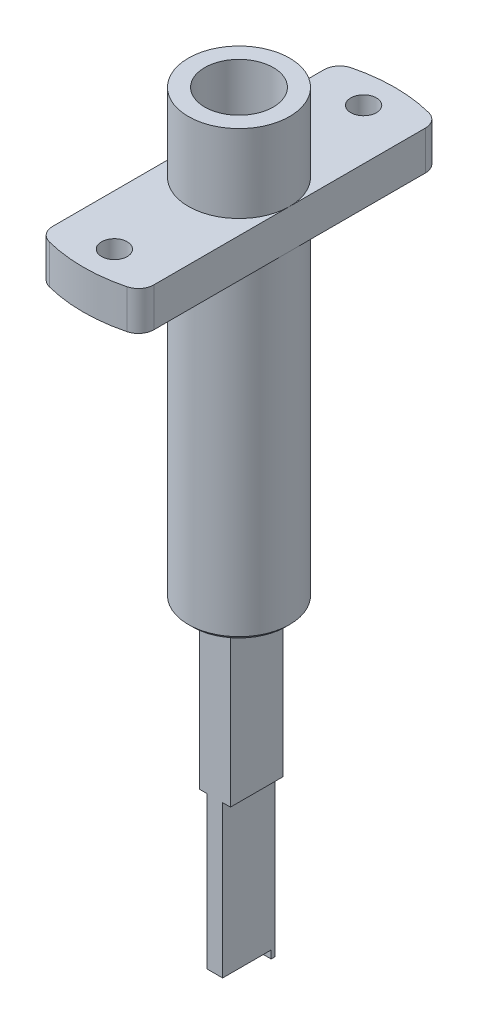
ISO-10303-21;
HEADER;
FILE_DESCRIPTION(('STEP AP214'),'2;1');
FILE_NAME('part.step','',(''),(''),'','','');
FILE_SCHEMA(('AUTOMOTIVE_DESIGN { 1 0 10303 214 1 1 1 1 }'));
ENDSEC;
DATA;
#1=APPLICATION_CONTEXT('core data for automotive mechanical design processes');
#2=APPLICATION_PROTOCOL_DEFINITION('international standard','automotive_design',2000,#1);
#3=PRODUCT_CONTEXT('',#1,'mechanical');
#4=PRODUCT('Part','Part','',(#3));
#5=PRODUCT_RELATED_PRODUCT_CATEGORY('part','',(#4));
#6=PRODUCT_DEFINITION_FORMATION('','',#4);
#7=PRODUCT_DEFINITION_CONTEXT('part definition',#1,'design');
#8=PRODUCT_DEFINITION('design','',#6,#7);
#9=PRODUCT_DEFINITION_SHAPE('','',#8);
#10=(LENGTH_UNIT() NAMED_UNIT(*) SI_UNIT(.MILLI.,.METRE.));
#11=(NAMED_UNIT(*) PLANE_ANGLE_UNIT() SI_UNIT($,.RADIAN.));
#12=(NAMED_UNIT(*) SI_UNIT($,.STERADIAN.) SOLID_ANGLE_UNIT());
#13=UNCERTAINTY_MEASURE_WITH_UNIT(LENGTH_MEASURE(1.E-05),#10,'distance_accuracy_value','');
#14=(GEOMETRIC_REPRESENTATION_CONTEXT(3) GLOBAL_UNCERTAINTY_ASSIGNED_CONTEXT((#13)) GLOBAL_UNIT_ASSIGNED_CONTEXT((#10,
#11,#12)) REPRESENTATION_CONTEXT('',''));
#15=CARTESIAN_POINT('',(0.,0.,0.));
#16=DIRECTION('',(0.,0.,1.));
#17=DIRECTION('',(1.,0.,0.));
#18=AXIS2_PLACEMENT_3D('',#15,#16,#17);
#19=CARTESIAN_POINT('',(-1.,-75.5,-5.1234753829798));
#20=DIRECTION('',(1.,0.,0.));
#21=DIRECTION('',(0.,0.,-1.));
#22=AXIS2_PLACEMENT_3D('',#19,#20,#21);
#23=PLANE('',#22);
#24=DIRECTION('',(0.,0.,1.));
#25=VECTOR('',#24,1.);
#26=CARTESIAN_POINT('',(-1.,-95.,0.));
#27=LINE('',#26,#25);
#28=CARTESIAN_POINT('',(-1.,-95.,-3.1234753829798));
#29=VERTEX_POINT('',#28);
#30=CARTESIAN_POINT('',(-1.,-95.,-2.1234753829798));
#31=VERTEX_POINT('',#30);
#32=EDGE_CURVE('E302',#29,#31,#27,.T.);
#33=ORIENTED_EDGE('',*,*,#32,.T.);
#34=DIRECTION('',(0.,-1.,0.));
#35=VECTOR('',#34,1.);
#36=CARTESIAN_POINT('',(-1.,-94.2928932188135,-2.1234753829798));
#37=LINE('',#36,#35);
#38=CARTESIAN_POINT('',(-1.,-96.,-2.1234753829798));
#39=VERTEX_POINT('',#38);
#40=EDGE_CURVE('E290',#31,#39,#37,.T.);
#41=ORIENTED_EDGE('',*,*,#40,.T.);
#42=DIRECTION('',(0.,0.,-1.));
#43=VECTOR('',#42,1.);
#44=CARTESIAN_POINT('',(-1.,-96.,2.6));
#45=LINE('',#44,#43);
#46=CARTESIAN_POINT('',(-1.,-96.,2.1));
#47=VERTEX_POINT('',#46);
#48=EDGE_CURVE('E299',#47,#39,#45,.T.);
#49=ORIENTED_EDGE('',*,*,#48,.F.);
#50=DIRECTION('',(0.,-1.,0.));
#51=VECTOR('',#50,1.);
#52=CARTESIAN_POINT('',(-1.,-94.2928932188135,2.1));
#53=LINE('',#52,#51);
#54=CARTESIAN_POINT('',(-1.,-95.,2.1));
#55=VERTEX_POINT('',#54);
#56=EDGE_CURVE('E125',#55,#47,#53,.T.);
#57=ORIENTED_EDGE('',*,*,#56,.F.);
#58=CARTESIAN_POINT('',(-1.,-95.,3.1));
#59=VERTEX_POINT('',#58);
#60=EDGE_CURVE('E356',#55,#59,#27,.T.);
#61=ORIENTED_EDGE('',*,*,#60,.T.);
#62=DIRECTION('',(0.,1.,0.));
#63=VECTOR('',#62,1.);
#64=CARTESIAN_POINT('',(-1.,-75.5,3.1));
#65=LINE('',#64,#63);
#66=CARTESIAN_POINT('',(-1.,-75.5,3.1));
#67=VERTEX_POINT('',#66);
#68=EDGE_CURVE('E596',#59,#67,#65,.T.);
#69=ORIENTED_EDGE('',*,*,#68,.T.);
#70=DIRECTION('',(0.,0.,1.));
#71=VECTOR('',#70,1.);
#72=CARTESIAN_POINT('',(-1.,-75.5,-5.1234753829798));
#73=LINE('',#72,#71);
#74=CARTESIAN_POINT('',(-1.,-75.5,-3.6234753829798));
#75=VERTEX_POINT('',#74);
#76=EDGE_CURVE('E351',#75,#67,#73,.T.);
#77=ORIENTED_EDGE('',*,*,#76,.F.);
#78=DIRECTION('',(0.,-1.,0.));
#79=VECTOR('',#78,1.);
#80=CARTESIAN_POINT('',(-1.,-75.5,-3.6234753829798));
#81=LINE('',#80,#79);
#82=CARTESIAN_POINT('',(-1.,-96.,-3.6234753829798));
#83=VERTEX_POINT('',#82);
#84=EDGE_CURVE('E318',#75,#83,#81,.T.);
#85=ORIENTED_EDGE('',*,*,#84,.T.);
#86=DIRECTION('',(0.,0.,-1.));
#87=VECTOR('',#86,1.);
#88=CARTESIAN_POINT('',(-1.,-96.,-5.1234753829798));
#89=LINE('',#88,#87);
#90=CARTESIAN_POINT('',(-1.,-96.,-3.1234753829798));
#91=VERTEX_POINT('',#90);
#92=EDGE_CURVE('E327',#91,#83,#89,.T.);
#93=ORIENTED_EDGE('',*,*,#92,.F.);
#94=DIRECTION('',(0.,1.,0.));
#95=VECTOR('',#94,1.);
#96=CARTESIAN_POINT('',(-1.,-96.,-3.1234753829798));
#97=LINE('',#96,#95);
#98=EDGE_CURVE('E330',#91,#29,#97,.T.);
#99=ORIENTED_EDGE('',*,*,#98,.T.);
#100=EDGE_LOOP('',(#33,#41,#49,#57,#61,#69,#77,#85,#93,#99));
#101=FACE_BOUND('',#100,.T.);
#102=ADVANCED_FACE('F101',(#101),#23,.F.);
#103=CARTESIAN_POINT('',(1.,-75.5,4.6));
#104=DIRECTION('',(-1.,0.,0.));
#105=DIRECTION('',(0.,0.,1.));
#106=AXIS2_PLACEMENT_3D('',#103,#104,#105);
#107=PLANE('',#106);
#108=DIRECTION('',(0.,0.,-1.));
#109=VECTOR('',#108,1.);
#110=CARTESIAN_POINT('',(1.,-75.5,4.6));
#111=LINE('',#110,#109);
#112=CARTESIAN_POINT('',(1.,-75.5,3.1));
#113=VERTEX_POINT('',#112);
#114=CARTESIAN_POINT('',(1.,-75.5,-3.6234753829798));
#115=VERTEX_POINT('',#114);
#116=EDGE_CURVE('E342',#113,#115,#111,.T.);
#117=ORIENTED_EDGE('',*,*,#116,.F.);
#118=DIRECTION('',(0.,-1.,0.));
#119=VECTOR('',#118,1.);
#120=CARTESIAN_POINT('',(1.,-75.5,3.1));
#121=LINE('',#120,#119);
#122=CARTESIAN_POINT('',(1.,-95.,3.1));
#123=VERTEX_POINT('',#122);
#124=EDGE_CURVE('E583',#113,#123,#121,.T.);
#125=ORIENTED_EDGE('',*,*,#124,.T.);
#126=DIRECTION('',(0.,0.,-1.));
#127=VECTOR('',#126,1.);
#128=CARTESIAN_POINT('',(1.,-95.,0.));
#129=LINE('',#128,#127);
#130=CARTESIAN_POINT('',(1.,-95.,-3.1234753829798));
#131=VERTEX_POINT('',#130);
#132=EDGE_CURVE('E345',#123,#131,#129,.T.);
#133=ORIENTED_EDGE('',*,*,#132,.T.);
#134=DIRECTION('',(0.,1.,0.));
#135=VECTOR('',#134,1.);
#136=CARTESIAN_POINT('',(1.,-96.,-3.1234753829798));
#137=LINE('',#136,#135);
#138=CARTESIAN_POINT('',(1.,-96.,-3.1234753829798));
#139=VERTEX_POINT('',#138);
#140=EDGE_CURVE('E334',#139,#131,#137,.T.);
#141=ORIENTED_EDGE('',*,*,#140,.F.);
#142=DIRECTION('',(0.,0.,1.));
#143=VECTOR('',#142,1.);
#144=CARTESIAN_POINT('',(1.,-96.,-5.1234753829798));
#145=LINE('',#144,#143);
#146=CARTESIAN_POINT('',(1.,-96.,-3.6234753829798));
#147=VERTEX_POINT('',#146);
#148=EDGE_CURVE('E315',#147,#139,#145,.T.);
#149=ORIENTED_EDGE('',*,*,#148,.F.);
#150=DIRECTION('',(0.,1.,0.));
#151=VECTOR('',#150,1.);
#152=CARTESIAN_POINT('',(1.,-75.5,-3.6234753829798));
#153=LINE('',#152,#151);
#154=EDGE_CURVE('E543',#147,#115,#153,.T.);
#155=ORIENTED_EDGE('',*,*,#154,.T.);
#156=EDGE_LOOP('',(#117,#125,#133,#141,#149,#155));
#157=FACE_BOUND('',#156,.T.);
#158=ADVANCED_FACE('F641',(#157),#107,.F.);
#159=CARTESIAN_POINT('',(0.,-95.,0.));
#160=DIRECTION('',(0.,-1.,0.));
#161=DIRECTION('',(0.,0.,-1.));
#162=AXIS2_PLACEMENT_3D('',#159,#160,#161);
#163=PLANE('',#162);
#164=DIRECTION('',(0.,0.,1.));
#165=VECTOR('',#164,1.);
#166=CARTESIAN_POINT('',(-0.5,-95.,2.6));
#167=LINE('',#166,#165);
#168=CARTESIAN_POINT('',(-0.5,-95.,-2.1234753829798));
#169=VERTEX_POINT('',#168);
#170=CARTESIAN_POINT('',(-0.5,-95.,-1.5));
#171=VERTEX_POINT('',#170);
#172=EDGE_CURVE('E357',#169,#171,#167,.T.);
#173=ORIENTED_EDGE('',*,*,#172,.F.);
#174=DIRECTION('',(1.,0.,0.));
#175=VECTOR('',#174,1.);
#176=CARTESIAN_POINT('',(-0.5,-95.,-2.1234753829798));
#177=LINE('',#176,#175);
#178=EDGE_CURVE('E304',#31,#169,#177,.T.);
#179=ORIENTED_EDGE('',*,*,#178,.F.);
#180=ORIENTED_EDGE('',*,*,#32,.F.);
#181=DIRECTION('',(-1.,0.,0.));
#182=VECTOR('',#181,1.);
#183=CARTESIAN_POINT('',(1.,-95.,-3.1234753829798));
#184=LINE('',#183,#182);
#185=EDGE_CURVE('E309',#131,#29,#184,.T.);
#186=ORIENTED_EDGE('',*,*,#185,.F.);
#187=ORIENTED_EDGE('',*,*,#132,.F.);
#188=DIRECTION('',(1.,0.,0.));
#189=VECTOR('',#188,1.);
#190=CARTESIAN_POINT('',(0.,-95.,3.1));
#191=LINE('',#190,#189);
#192=EDGE_CURVE('E593',#59,#123,#191,.T.);
#193=ORIENTED_EDGE('',*,*,#192,.F.);
#194=ORIENTED_EDGE('',*,*,#60,.F.);
#195=DIRECTION('',(-1.,0.,0.));
#196=VECTOR('',#195,1.);
#197=CARTESIAN_POINT('',(-0.5,-95.,2.1));
#198=LINE('',#197,#196);
#199=CARTESIAN_POINT('',(-0.5,-95.,2.1));
#200=VERTEX_POINT('',#199);
#201=EDGE_CURVE('E570',#200,#55,#198,.T.);
#202=ORIENTED_EDGE('',*,*,#201,.F.);
#203=CARTESIAN_POINT('',(-0.5,-95.,1.5));
#204=VERTEX_POINT('',#203);
#205=EDGE_CURVE('E361',#204,#200,#167,.T.);
#206=ORIENTED_EDGE('',*,*,#205,.F.);
#207=CARTESIAN_POINT('',(0.,-95.,1.5));
#208=DIRECTION('',(0.,-1.,0.));
#209=DIRECTION('',(0.,0.,-1.));
#210=AXIS2_PLACEMENT_3D('',#207,#208,#209);
#211=CIRCLE('',#210,0.5);
#212=CARTESIAN_POINT('',(0.5,-95.,1.5));
#213=VERTEX_POINT('',#212);
#214=EDGE_CURVE('E380',#213,#204,#211,.T.);
#215=ORIENTED_EDGE('',*,*,#214,.F.);
#216=DIRECTION('',(0.,0.,1.));
#217=VECTOR('',#216,1.);
#218=CARTESIAN_POINT('',(0.5,-95.,-1.5));
#219=LINE('',#218,#217);
#220=CARTESIAN_POINT('',(0.5,-95.,-1.5));
#221=VERTEX_POINT('',#220);
#222=EDGE_CURVE('E376',#221,#213,#219,.T.);
#223=ORIENTED_EDGE('',*,*,#222,.F.);
#224=CARTESIAN_POINT('',(0.,-95.,-1.5));
#225=DIRECTION('',(0.,-1.,0.));
#226=DIRECTION('',(0.,0.,-1.));
#227=AXIS2_PLACEMENT_3D('',#224,#225,#226);
#228=CIRCLE('',#227,0.5);
#229=EDGE_CURVE('E373',#171,#221,#228,.T.);
#230=ORIENTED_EDGE('',*,*,#229,.F.);
#231=EDGE_LOOP('',(#173,#179,#180,#186,#187,#193,#194,#202,#206,#215,#223,#230));
#232=FACE_BOUND('',#231,.T.);
#233=ADVANCED_FACE('F560',(#232),#163,.T.);
#234=CARTESIAN_POINT('',(2.,-44.1717960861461,5.1234753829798));
#235=DIRECTION('',(-1.,0.,0.));
#236=DIRECTION('',(0.,0.,1.));
#237=AXIS2_PLACEMENT_3D('',#234,#235,#236);
#238=PLANE('',#237);
#239=DIRECTION('',(0.,0.,1.));
#240=VECTOR('',#239,1.);
#241=CARTESIAN_POINT('',(2.,-55.,5.1234753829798));
#242=LINE('',#241,#240);
#243=CARTESIAN_POINT('',(2.,-55.,-3.6234753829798));
#244=VERTEX_POINT('',#243);
#245=CARTESIAN_POINT('',(2.,-55.,3.1));
#246=VERTEX_POINT('',#245);
#247=EDGE_CURVE('E406',#244,#246,#242,.T.);
#248=ORIENTED_EDGE('',*,*,#247,.T.);
#249=DIRECTION('',(0.,-1.,0.));
#250=VECTOR('',#249,1.);
#251=CARTESIAN_POINT('',(2.,-50.7279981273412,3.1));
#252=LINE('',#251,#250);
#253=CARTESIAN_POINT('',(2.,-75.5,3.1));
#254=VERTEX_POINT('',#253);
#255=EDGE_CURVE('E584',#246,#254,#252,.T.);
#256=ORIENTED_EDGE('',*,*,#255,.T.);
#257=DIRECTION('',(0.,0.,1.));
#258=VECTOR('',#257,1.);
#259=CARTESIAN_POINT('',(2.,-75.5,4.6));
#260=LINE('',#259,#258);
#261=CARTESIAN_POINT('',(2.,-75.5,-3.6234753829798));
#262=VERTEX_POINT('',#261);
#263=EDGE_CURVE('E338',#262,#254,#260,.T.);
#264=ORIENTED_EDGE('',*,*,#263,.F.);
#265=DIRECTION('',(0.,-1.,0.));
#266=VECTOR('',#265,1.);
#267=CARTESIAN_POINT('',(2.,-50.7279981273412,-3.6234753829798));
#268=LINE('',#267,#266);
#269=EDGE_CURVE('E603',#244,#262,#268,.T.);
#270=ORIENTED_EDGE('',*,*,#269,.F.);
#271=EDGE_LOOP('',(#248,#256,#264,#270));
#272=FACE_BOUND('',#271,.T.);
#273=ADVANCED_FACE('F636',(#272),#238,.F.);
#274=CARTESIAN_POINT('',(-2.,-44.1717960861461,5.1234753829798));
#275=DIRECTION('',(1.,0.,0.));
#276=DIRECTION('',(0.,0.,-1.));
#277=AXIS2_PLACEMENT_3D('',#274,#275,#276);
#278=PLANE('',#277);
#279=DIRECTION('',(0.,0.,-1.));
#280=VECTOR('',#279,1.);
#281=CARTESIAN_POINT('',(-2.,-75.5,-5.1234753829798));
#282=LINE('',#281,#280);
#283=CARTESIAN_POINT('',(-2.,-75.5,3.1));
#284=VERTEX_POINT('',#283);
#285=CARTESIAN_POINT('',(-2.,-75.5,-3.6234753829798));
#286=VERTEX_POINT('',#285);
#287=EDGE_CURVE('E348',#284,#286,#282,.T.);
#288=ORIENTED_EDGE('',*,*,#287,.F.);
#289=DIRECTION('',(0.,-1.,0.));
#290=VECTOR('',#289,1.);
#291=CARTESIAN_POINT('',(-2.,-50.7279981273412,3.1));
#292=LINE('',#291,#290);
#293=CARTESIAN_POINT('',(-2.,-55.,3.1));
#294=VERTEX_POINT('',#293);
#295=EDGE_CURVE('E572',#294,#284,#292,.T.);
#296=ORIENTED_EDGE('',*,*,#295,.F.);
#297=DIRECTION('',(0.,0.,-1.));
#298=VECTOR('',#297,1.);
#299=CARTESIAN_POINT('',(-2.,-55.,5.1234753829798));
#300=LINE('',#299,#298);
#301=CARTESIAN_POINT('',(-2.,-55.,-3.6234753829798));
#302=VERTEX_POINT('',#301);
#303=EDGE_CURVE('E403',#294,#302,#300,.T.);
#304=ORIENTED_EDGE('',*,*,#303,.T.);
#305=DIRECTION('',(0.,-1.,0.));
#306=VECTOR('',#305,1.);
#307=CARTESIAN_POINT('',(-2.,-50.7279981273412,-3.6234753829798));
#308=LINE('',#307,#306);
#309=EDGE_CURVE('E604',#302,#286,#308,.T.);
#310=ORIENTED_EDGE('',*,*,#309,.T.);
#311=EDGE_LOOP('',(#288,#296,#304,#310));
#312=FACE_BOUND('',#311,.T.);
#313=ADVANCED_FACE('F625',(#312),#278,.F.);
#314=CARTESIAN_POINT('',(0.,78.734060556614,0.));
#315=DIRECTION('',(0.,1.,0.));
#316=DIRECTION('',(0.,0.,1.));
#317=AXIS2_PLACEMENT_3D('',#314,#315,#316);
#318=CYLINDRICAL_SURFACE('',#317,6.49999999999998);
#319=CARTESIAN_POINT('',(0.,-54.5,0.));
#320=DIRECTION('',(0.,-1.,0.));
#321=DIRECTION('',(0.,0.,-1.));
#322=AXIS2_PLACEMENT_3D('',#319,#320,#321);
#323=CIRCLE('',#322,6.49999999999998);
#324=CARTESIAN_POINT('',(0.,-54.5,-6.49999999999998));
#325=VERTEX_POINT('',#324);
#326=EDGE_CURVE('E531',#325,#325,#323,.F.);
#327=ORIENTED_EDGE('',*,*,#326,.T.);
#328=EDGE_LOOP('',(#327));
#329=FACE_BOUND('',#328,.T.);
#330=CARTESIAN_POINT('',(0.,-13.,0.));
#331=DIRECTION('',(0.,1.,0.));
#332=DIRECTION('',(0.,0.,1.));
#333=AXIS2_PLACEMENT_3D('',#330,#331,#332);
#334=CIRCLE('',#333,6.49999999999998);
#335=CARTESIAN_POINT('',(-6.5,-13.,0.));
#336=VERTEX_POINT('',#335);
#337=CARTESIAN_POINT('',(6.50000000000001,-13.,0.));
#338=VERTEX_POINT('',#337);
#339=EDGE_CURVE('E463',#336,#338,#334,.F.);
#340=ORIENTED_EDGE('',*,*,#339,.T.);
#341=EDGE_CURVE('E468',#338,#336,#334,.F.);
#342=ORIENTED_EDGE('',*,*,#341,.T.);
#343=EDGE_LOOP('',(#340,#342));
#344=FACE_BOUND('',#343,.T.);
#345=ADVANCED_FACE('F690',(#329,#344),#318,.T.);
#346=CARTESIAN_POINT('',(0.,-8.,0.));
#347=DIRECTION('',(0.,1.,0.));
#348=DIRECTION('',(0.,0.,1.));
#349=AXIS2_PLACEMENT_3D('',#346,#347,#348);
#350=PLANE('',#349);
#351=CARTESIAN_POINT('',(0.,-8.,0.));
#352=DIRECTION('',(0.,1.,0.));
#353=DIRECTION('',(0.,0.,1.));
#354=AXIS2_PLACEMENT_3D('',#351,#352,#353);
#355=CIRCLE('',#354,20.);
#356=CARTESIAN_POINT('',(5.00000000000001,-8.,-19.3649167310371));
#357=VERTEX_POINT('',#356);
#358=CARTESIAN_POINT('',(-5.,-8.,-19.3649167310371));
#359=VERTEX_POINT('',#358);
#360=EDGE_CURVE('E453',#357,#359,#355,.T.);
#361=ORIENTED_EDGE('',*,*,#360,.T.);
#362=CARTESIAN_POINT('',(-4.5,-8.,-17.4284250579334));
#363=DIRECTION('',(0.,1.,0.));
#364=DIRECTION('',(0.,0.,1.));
#365=AXIS2_PLACEMENT_3D('',#362,#363,#364);
#366=CIRCLE('',#365,2.);
#367=CARTESIAN_POINT('',(-6.5,-8.,-17.4284250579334));
#368=VERTEX_POINT('',#367);
#369=EDGE_CURVE('E524',#359,#368,#366,.T.);
#370=ORIENTED_EDGE('',*,*,#369,.T.);
#371=DIRECTION('',(0.,0.,-1.));
#372=VECTOR('',#371,1.);
#373=CARTESIAN_POINT('',(-6.5,-8.,0.));
#374=LINE('',#373,#372);
#375=CARTESIAN_POINT('',(-6.5,-8.,0.));
#376=VERTEX_POINT('',#375);
#377=EDGE_CURVE('E467',#376,#368,#374,.T.);
#378=ORIENTED_EDGE('',*,*,#377,.F.);
#379=CARTESIAN_POINT('',(0.,-8.,0.));
#380=DIRECTION('',(0.,1.,0.));
#381=DIRECTION('',(0.,0.,1.));
#382=AXIS2_PLACEMENT_3D('',#379,#380,#381);
#383=CIRCLE('',#382,6.5);
#384=CARTESIAN_POINT('',(6.5,-8.,0.));
#385=VERTEX_POINT('',#384);
#386=EDGE_CURVE('E418',#385,#376,#383,.T.);
#387=ORIENTED_EDGE('',*,*,#386,.F.);
#388=DIRECTION('',(0.,0.,1.));
#389=VECTOR('',#388,1.);
#390=CARTESIAN_POINT('',(6.50000000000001,-8.,0.));
#391=LINE('',#390,#389);
#392=CARTESIAN_POINT('',(6.50000000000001,-8.,-17.4284250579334));
#393=VERTEX_POINT('',#392);
#394=EDGE_CURVE('E473',#393,#385,#391,.T.);
#395=ORIENTED_EDGE('',*,*,#394,.F.);
#396=CARTESIAN_POINT('',(4.50000000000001,-8.,-17.4284250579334));
#397=DIRECTION('',(0.,1.,0.));
#398=DIRECTION('',(0.,0.,1.));
#399=AXIS2_PLACEMENT_3D('',#396,#397,#398);
#400=CIRCLE('',#399,2.);
#401=EDGE_CURVE('E521',#393,#357,#400,.T.);
#402=ORIENTED_EDGE('',*,*,#401,.T.);
#403=EDGE_LOOP('',(#361,#370,#378,#387,#395,#402));
#404=FACE_BOUND('',#403,.T.);
#405=CARTESIAN_POINT('',(0.,-8.,-16.));
#406=DIRECTION('',(0.,1.,0.));
#407=DIRECTION('',(0.,0.,1.));
#408=AXIS2_PLACEMENT_3D('',#405,#406,#407);
#409=CIRCLE('',#408,1.65);
#410=CARTESIAN_POINT('',(0.,-8.,-14.35));
#411=VERTEX_POINT('',#410);
#412=EDGE_CURVE('E445',#411,#411,#409,.T.);
#413=ORIENTED_EDGE('',*,*,#412,.F.);
#414=EDGE_LOOP('',(#413));
#415=FACE_BOUND('',#414,.T.);
#416=ADVANCED_FACE('F740',(#404,#415),#350,.T.);
#417=CARTESIAN_POINT('',(0.,-13.,0.));
#418=DIRECTION('',(0.,1.,0.));
#419=DIRECTION('',(0.,0.,1.));
#420=AXIS2_PLACEMENT_3D('',#417,#418,#419);
#421=CYLINDRICAL_SURFACE('',#420,20.);
#422=CARTESIAN_POINT('',(-5.,-8.,19.3649167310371));
#423=VERTEX_POINT('',#422);
#424=CARTESIAN_POINT('',(5.00000000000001,-8.,19.3649167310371));
#425=VERTEX_POINT('',#424);
#426=EDGE_CURVE('E459',#423,#425,#355,.T.);
#427=ORIENTED_EDGE('',*,*,#426,.F.);
#428=DIRECTION('',(0.,1.,0.));
#429=VECTOR('',#428,1.);
#430=CARTESIAN_POINT('',(-5.,-13.,19.3649167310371));
#431=LINE('',#430,#429);
#432=CARTESIAN_POINT('',(-5.,-13.,19.3649167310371));
#433=VERTEX_POINT('',#432);
#434=EDGE_CURVE('E493',#423,#433,#431,.F.);
#435=ORIENTED_EDGE('',*,*,#434,.T.);
#436=CARTESIAN_POINT('',(0.,-13.,0.));
#437=DIRECTION('',(0.,1.,0.));
#438=DIRECTION('',(0.,0.,1.));
#439=AXIS2_PLACEMENT_3D('',#436,#437,#438);
#440=CIRCLE('',#439,20.);
#441=CARTESIAN_POINT('',(5.00000000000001,-13.,19.3649167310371));
#442=VERTEX_POINT('',#441);
#443=EDGE_CURVE('E458',#433,#442,#440,.T.);
#444=ORIENTED_EDGE('',*,*,#443,.T.);
#445=DIRECTION('',(0.,1.,0.));
#446=VECTOR('',#445,1.);
#447=CARTESIAN_POINT('',(5.00000000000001,-13.,19.3649167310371));
#448=LINE('',#447,#446);
#449=EDGE_CURVE('E490',#442,#425,#448,.T.);
#450=ORIENTED_EDGE('',*,*,#449,.T.);
#451=EDGE_LOOP('',(#427,#435,#444,#450));
#452=FACE_BOUND('',#451,.T.);
#453=ADVANCED_FACE('F736',(#452),#421,.T.);
#454=CARTESIAN_POINT('',(0.,-13.,0.));
#455=DIRECTION('',(0.,1.,0.));
#456=DIRECTION('',(0.,0.,1.));
#457=AXIS2_PLACEMENT_3D('',#454,#455,#456);
#458=PLANE('',#457);
#459=CARTESIAN_POINT('',(0.,-13.,-16.));
#460=DIRECTION('',(0.,1.,0.));
#461=DIRECTION('',(0.,0.,1.));
#462=AXIS2_PLACEMENT_3D('',#459,#460,#461);
#463=CIRCLE('',#462,1.65);
#464=CARTESIAN_POINT('',(0.,-13.,-14.35));
#465=VERTEX_POINT('',#464);
#466=EDGE_CURVE('E449',#465,#465,#463,.T.);
#467=ORIENTED_EDGE('',*,*,#466,.T.);
#468=EDGE_LOOP('',(#467));
#469=FACE_BOUND('',#468,.T.);
#470=DIRECTION('',(0.,0.,-1.));
#471=VECTOR('',#470,1.);
#472=CARTESIAN_POINT('',(-6.5,-13.,0.));
#473=LINE('',#472,#471);
#474=CARTESIAN_POINT('',(-6.5,-13.,-17.4284250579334));
#475=VERTEX_POINT('',#474);
#476=EDGE_CURVE('E432',#336,#475,#473,.T.);
#477=ORIENTED_EDGE('',*,*,#476,.T.);
#478=CARTESIAN_POINT('',(-4.5,-13.,-17.4284250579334));
#479=DIRECTION('',(0.,1.,0.));
#480=DIRECTION('',(0.,0.,1.));
#481=AXIS2_PLACEMENT_3D('',#478,#479,#480);
#482=CIRCLE('',#481,2.);
#483=CARTESIAN_POINT('',(-5.,-13.,-19.3649167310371));
#484=VERTEX_POINT('',#483);
#485=EDGE_CURVE('E512',#475,#484,#482,.F.);
#486=ORIENTED_EDGE('',*,*,#485,.T.);
#487=CARTESIAN_POINT('',(5.00000000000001,-13.,-19.3649167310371));
#488=VERTEX_POINT('',#487);
#489=EDGE_CURVE('E454',#488,#484,#440,.T.);
#490=ORIENTED_EDGE('',*,*,#489,.F.);
#491=CARTESIAN_POINT('',(4.50000000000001,-13.,-17.4284250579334));
#492=DIRECTION('',(0.,1.,0.));
#493=DIRECTION('',(0.,0.,1.));
#494=AXIS2_PLACEMENT_3D('',#491,#492,#493);
#495=CIRCLE('',#494,2.);
#496=CARTESIAN_POINT('',(6.50000000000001,-13.,-17.4284250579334));
#497=VERTEX_POINT('',#496);
#498=EDGE_CURVE('E509',#488,#497,#495,.F.);
#499=ORIENTED_EDGE('',*,*,#498,.T.);
#500=DIRECTION('',(0.,0.,1.));
#501=VECTOR('',#500,1.);
#502=CARTESIAN_POINT('',(6.50000000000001,-13.,0.));
#503=LINE('',#502,#501);
#504=EDGE_CURVE('E431',#497,#338,#503,.T.);
#505=ORIENTED_EDGE('',*,*,#504,.T.);
#506=ORIENTED_EDGE('',*,*,#339,.F.);
#507=EDGE_LOOP('',(#477,#486,#490,#499,#505,#506));
#508=FACE_BOUND('',#507,.T.);
#509=ADVANCED_FACE('F732',(#469,#508),#458,.F.);
#510=ORIENTED_EDGE('',*,*,#489,.T.);
#511=DIRECTION('',(0.,1.,0.));
#512=VECTOR('',#511,1.);
#513=CARTESIAN_POINT('',(-5.,-13.,-19.3649167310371));
#514=LINE('',#513,#512);
#515=EDGE_CURVE('E518',#484,#359,#514,.T.);
#516=ORIENTED_EDGE('',*,*,#515,.T.);
#517=ORIENTED_EDGE('',*,*,#360,.F.);
#518=DIRECTION('',(0.,1.,0.));
#519=VECTOR('',#518,1.);
#520=CARTESIAN_POINT('',(5.00000000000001,-13.,-19.3649167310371));
#521=LINE('',#520,#519);
#522=EDGE_CURVE('E515',#357,#488,#521,.F.);
#523=ORIENTED_EDGE('',*,*,#522,.T.);
#524=EDGE_LOOP('',(#510,#516,#517,#523));
#525=FACE_BOUND('',#524,.T.);
#526=ADVANCED_FACE('F730',(#525),#421,.T.);
#527=CARTESIAN_POINT('',(0.,-13.,16.));
#528=DIRECTION('',(0.,1.,0.));
#529=DIRECTION('',(0.,0.,1.));
#530=AXIS2_PLACEMENT_3D('',#527,#528,#529);
#531=CIRCLE('',#530,1.65);
#532=CARTESIAN_POINT('',(0.,-13.,17.65));
#533=VERTEX_POINT('',#532);
#534=EDGE_CURVE('E441',#533,#533,#531,.T.);
#535=ORIENTED_EDGE('',*,*,#534,.T.);
#536=EDGE_LOOP('',(#535));
#537=FACE_BOUND('',#536,.T.);
#538=ORIENTED_EDGE('',*,*,#443,.F.);
#539=CARTESIAN_POINT('',(-4.5,-13.,17.4284250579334));
#540=DIRECTION('',(0.,1.,0.));
#541=DIRECTION('',(0.,0.,1.));
#542=AXIS2_PLACEMENT_3D('',#539,#540,#541);
#543=CIRCLE('',#542,2.);
#544=CARTESIAN_POINT('',(-6.5,-13.,17.4284250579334));
#545=VERTEX_POINT('',#544);
#546=EDGE_CURVE('E499',#433,#545,#543,.F.);
#547=ORIENTED_EDGE('',*,*,#546,.T.);
#548=EDGE_CURVE('E436',#545,#336,#473,.T.);
#549=ORIENTED_EDGE('',*,*,#548,.T.);
#550=ORIENTED_EDGE('',*,*,#341,.F.);
#551=CARTESIAN_POINT('',(6.50000000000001,-13.,17.4284250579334));
#552=VERTEX_POINT('',#551);
#553=EDGE_CURVE('E423',#338,#552,#503,.T.);
#554=ORIENTED_EDGE('',*,*,#553,.T.);
#555=CARTESIAN_POINT('',(4.50000000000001,-13.,17.4284250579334));
#556=DIRECTION('',(0.,1.,0.));
#557=DIRECTION('',(0.,0.,1.));
#558=AXIS2_PLACEMENT_3D('',#555,#556,#557);
#559=CIRCLE('',#558,2.);
#560=EDGE_CURVE('E496',#552,#442,#559,.F.);
#561=ORIENTED_EDGE('',*,*,#560,.T.);
#562=EDGE_LOOP('',(#538,#547,#549,#550,#554,#561));
#563=FACE_BOUND('',#562,.T.);
#564=ADVANCED_FACE('F727',(#537,#563),#458,.F.);
#565=CARTESIAN_POINT('',(-6.5,-8.,17.4284250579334));
#566=VERTEX_POINT('',#565);
#567=EDGE_CURVE('E469',#566,#376,#374,.T.);
#568=ORIENTED_EDGE('',*,*,#567,.F.);
#569=CARTESIAN_POINT('',(-4.5,-8.,17.4284250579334));
#570=DIRECTION('',(0.,1.,0.));
#571=DIRECTION('',(0.,0.,1.));
#572=AXIS2_PLACEMENT_3D('',#569,#570,#571);
#573=CIRCLE('',#572,2.);
#574=EDGE_CURVE('E487',#566,#423,#573,.T.);
#575=ORIENTED_EDGE('',*,*,#574,.T.);
#576=ORIENTED_EDGE('',*,*,#426,.T.);
#577=CARTESIAN_POINT('',(4.50000000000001,-8.,17.4284250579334));
#578=DIRECTION('',(0.,1.,0.));
#579=DIRECTION('',(0.,0.,1.));
#580=AXIS2_PLACEMENT_3D('',#577,#578,#579);
#581=CIRCLE('',#580,2.);
#582=CARTESIAN_POINT('',(6.50000000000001,-8.,17.4284250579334));
#583=VERTEX_POINT('',#582);
#584=EDGE_CURVE('E484',#425,#583,#581,.T.);
#585=ORIENTED_EDGE('',*,*,#584,.T.);
#586=EDGE_CURVE('E472',#385,#583,#391,.T.);
#587=ORIENTED_EDGE('',*,*,#586,.F.);
#588=EDGE_CURVE('E427',#376,#385,#383,.T.);
#589=ORIENTED_EDGE('',*,*,#588,.F.);
#590=EDGE_LOOP('',(#568,#575,#576,#585,#587,#589));
#591=FACE_BOUND('',#590,.T.);
#592=CARTESIAN_POINT('',(0.,-8.,16.));
#593=DIRECTION('',(0.,1.,0.));
#594=DIRECTION('',(0.,0.,1.));
#595=AXIS2_PLACEMENT_3D('',#592,#593,#594);
#596=CIRCLE('',#595,1.65);
#597=CARTESIAN_POINT('',(0.,-8.,17.65));
#598=VERTEX_POINT('',#597);
#599=EDGE_CURVE('E437',#598,#598,#596,.T.);
#600=ORIENTED_EDGE('',*,*,#599,.F.);
#601=EDGE_LOOP('',(#600));
#602=FACE_BOUND('',#601,.T.);
#603=ADVANCED_FACE('F725',(#591,#602),#350,.T.);
#604=CARTESIAN_POINT('',(0.,-8.,-16.));
#605=DIRECTION('',(0.,1.,0.));
#606=DIRECTION('',(0.,0.,1.));
#607=AXIS2_PLACEMENT_3D('',#604,#605,#606);
#608=CYLINDRICAL_SURFACE('',#607,1.65);
#609=ORIENTED_EDGE('',*,*,#412,.T.);
#610=EDGE_LOOP('',(#609));
#611=FACE_BOUND('',#610,.T.);
#612=ORIENTED_EDGE('',*,*,#466,.F.);
#613=EDGE_LOOP('',(#612));
#614=FACE_BOUND('',#613,.T.);
#615=ADVANCED_FACE('F721',(#611,#614),#608,.F.);
#616=CARTESIAN_POINT('',(0.,-8.,16.));
#617=DIRECTION('',(0.,1.,0.));
#618=DIRECTION('',(0.,0.,1.));
#619=AXIS2_PLACEMENT_3D('',#616,#617,#618);
#620=CYLINDRICAL_SURFACE('',#619,1.65);
#621=ORIENTED_EDGE('',*,*,#599,.T.);
#622=EDGE_LOOP('',(#621));
#623=FACE_BOUND('',#622,.T.);
#624=ORIENTED_EDGE('',*,*,#534,.F.);
#625=EDGE_LOOP('',(#624));
#626=FACE_BOUND('',#625,.T.);
#627=ADVANCED_FACE('F717',(#623,#626),#620,.F.);
#628=CARTESIAN_POINT('',(-6.5,-18.,-20.));
#629=DIRECTION('',(1.,0.,0.));
#630=DIRECTION('',(0.,0.,-1.));
#631=AXIS2_PLACEMENT_3D('',#628,#629,#630);
#632=PLANE('',#631);
#633=ORIENTED_EDGE('',*,*,#548,.F.);
#634=DIRECTION('',(0.,-1.,0.));
#635=VECTOR('',#634,1.);
#636=CARTESIAN_POINT('',(-6.5,-8.,17.4284250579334));
#637=LINE('',#636,#635);
#638=EDGE_CURVE('E480',#545,#566,#637,.F.);
#639=ORIENTED_EDGE('',*,*,#638,.T.);
#640=ORIENTED_EDGE('',*,*,#567,.T.);
#641=ORIENTED_EDGE('',*,*,#377,.T.);
#642=DIRECTION('',(0.,-1.,0.));
#643=VECTOR('',#642,1.);
#644=CARTESIAN_POINT('',(-6.5,-13.,-17.4284250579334));
#645=LINE('',#644,#643);
#646=EDGE_CURVE('E476',#368,#475,#645,.T.);
#647=ORIENTED_EDGE('',*,*,#646,.T.);
#648=ORIENTED_EDGE('',*,*,#476,.F.);
#649=EDGE_LOOP('',(#633,#639,#640,#641,#647,#648));
#650=FACE_BOUND('',#649,.T.);
#651=ADVANCED_FACE('F713',(#650),#632,.F.);
#652=CARTESIAN_POINT('',(6.50000000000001,-18.,-20.));
#653=DIRECTION('',(-1.,0.,0.));
#654=DIRECTION('',(0.,0.,1.));
#655=AXIS2_PLACEMENT_3D('',#652,#653,#654);
#656=PLANE('',#655);
#657=ORIENTED_EDGE('',*,*,#586,.T.);
#658=DIRECTION('',(0.,-1.,0.));
#659=VECTOR('',#658,1.);
#660=CARTESIAN_POINT('',(6.50000000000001,-13.,17.4284250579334));
#661=LINE('',#660,#659);
#662=EDGE_CURVE('E505',#583,#552,#661,.T.);
#663=ORIENTED_EDGE('',*,*,#662,.T.);
#664=ORIENTED_EDGE('',*,*,#553,.F.);
#665=ORIENTED_EDGE('',*,*,#504,.F.);
#666=DIRECTION('',(0.,-1.,0.));
#667=VECTOR('',#666,1.);
#668=CARTESIAN_POINT('',(6.50000000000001,-8.,-17.4284250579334));
#669=LINE('',#668,#667);
#670=EDGE_CURVE('E502',#497,#393,#669,.F.);
#671=ORIENTED_EDGE('',*,*,#670,.T.);
#672=ORIENTED_EDGE('',*,*,#394,.T.);
#673=EDGE_LOOP('',(#657,#663,#664,#665,#671,#672));
#674=FACE_BOUND('',#673,.T.);
#675=ADVANCED_FACE('F709',(#674),#656,.F.);
#676=CARTESIAN_POINT('',(0.,2.,0.));
#677=DIRECTION('',(0.,-1.,0.));
#678=DIRECTION('',(0.,0.,-1.));
#679=AXIS2_PLACEMENT_3D('',#676,#677,#678);
#680=CYLINDRICAL_SURFACE('',#679,6.5);
#681=CARTESIAN_POINT('',(0.,2.,0.));
#682=DIRECTION('',(0.,1.,0.));
#683=DIRECTION('',(0.,0.,1.));
#684=AXIS2_PLACEMENT_3D('',#681,#682,#683);
#685=CIRCLE('',#684,6.5);
#686=CARTESIAN_POINT('',(0.,2.,6.5));
#687=VERTEX_POINT('',#686);
#688=EDGE_CURVE('E419',#687,#687,#685,.T.);
#689=ORIENTED_EDGE('',*,*,#688,.F.);
#690=EDGE_LOOP('',(#689));
#691=FACE_BOUND('',#690,.T.);
#692=ORIENTED_EDGE('',*,*,#386,.T.);
#693=ORIENTED_EDGE('',*,*,#588,.T.);
#694=EDGE_LOOP('',(#692,#693));
#695=FACE_BOUND('',#694,.T.);
#696=ADVANCED_FACE('F705',(#691,#695),#680,.T.);
#697=CARTESIAN_POINT('',(0.,2.,0.));
#698=DIRECTION('',(0.,1.,0.));
#699=DIRECTION('',(0.,0.,1.));
#700=AXIS2_PLACEMENT_3D('',#697,#698,#699);
#701=PLANE('',#700);
#702=CARTESIAN_POINT('',(0.,2.,0.));
#703=DIRECTION('',(0.,1.,0.));
#704=DIRECTION('',(0.,0.,1.));
#705=AXIS2_PLACEMENT_3D('',#702,#703,#704);
#706=CIRCLE('',#705,4.39999999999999);
#707=CARTESIAN_POINT('',(0.,2.,4.39999999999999));
#708=VERTEX_POINT('',#707);
#709=EDGE_CURVE('E414',#708,#708,#706,.T.);
#710=ORIENTED_EDGE('',*,*,#709,.F.);
#711=EDGE_LOOP('',(#710));
#712=FACE_BOUND('',#711,.T.);
#713=ORIENTED_EDGE('',*,*,#688,.T.);
#714=EDGE_LOOP('',(#713));
#715=FACE_BOUND('',#714,.T.);
#716=ADVANCED_FACE('F702',(#712,#715),#701,.T.);
#717=CARTESIAN_POINT('',(0.,-55.,0.));
#718=DIRECTION('',(0.,-1.,0.));
#719=DIRECTION('',(0.,0.,-1.));
#720=AXIS2_PLACEMENT_3D('',#717,#718,#719);
#721=PLANE('',#720);
#722=DIRECTION('',(-1.,0.,0.));
#723=VECTOR('',#722,1.);
#724=CARTESIAN_POINT('',(2.,-55.,3.1));
#725=LINE('',#724,#723);
#726=EDGE_CURVE('E580',#246,#294,#725,.T.);
#727=ORIENTED_EDGE('',*,*,#726,.F.);
#728=ORIENTED_EDGE('',*,*,#247,.F.);
#729=DIRECTION('',(1.,0.,0.));
#730=VECTOR('',#729,1.);
#731=CARTESIAN_POINT('',(2.,-55.,-3.6234753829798));
#732=LINE('',#731,#730);
#733=EDGE_CURVE('E607',#302,#244,#732,.T.);
#734=ORIENTED_EDGE('',*,*,#733,.F.);
#735=ORIENTED_EDGE('',*,*,#303,.F.);
#736=EDGE_LOOP('',(#727,#728,#734,#735));
#737=FACE_BOUND('',#736,.T.);
#738=CARTESIAN_POINT('',(0.,-55.,0.));
#739=DIRECTION('',(0.,-1.,0.));
#740=DIRECTION('',(0.,0.,-1.));
#741=AXIS2_PLACEMENT_3D('',#738,#739,#740);
#742=CIRCLE('',#741,5.99999999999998);
#743=CARTESIAN_POINT('',(0.,-55.,-5.99999999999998));
#744=VERTEX_POINT('',#743);
#745=EDGE_CURVE('E527',#744,#744,#742,.T.);
#746=ORIENTED_EDGE('',*,*,#745,.T.);
#747=EDGE_LOOP('',(#746));
#748=FACE_BOUND('',#747,.T.);
#749=ADVANCED_FACE('F629',(#737,#748),#721,.T.);
#750=CARTESIAN_POINT('',(0.,2.,0.));
#751=DIRECTION('',(0.,1.,0.));
#752=DIRECTION('',(0.,0.,1.));
#753=AXIS2_PLACEMENT_3D('',#750,#751,#752);
#754=CYLINDRICAL_SURFACE('',#753,4.39999999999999);
#755=ORIENTED_EDGE('',*,*,#709,.T.);
#756=EDGE_LOOP('',(#755));
#757=FACE_BOUND('',#756,.T.);
#758=CARTESIAN_POINT('',(0.,-53.,0.));
#759=DIRECTION('',(0.,1.,0.));
#760=DIRECTION('',(0.,0.,1.));
#761=AXIS2_PLACEMENT_3D('',#758,#759,#760);
#762=CIRCLE('',#761,4.39999999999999);
#763=CARTESIAN_POINT('',(0.,-53.,4.39999999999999));
#764=VERTEX_POINT('',#763);
#765=EDGE_CURVE('E410',#764,#764,#762,.T.);
#766=ORIENTED_EDGE('',*,*,#765,.F.);
#767=EDGE_LOOP('',(#766));
#768=FACE_BOUND('',#767,.T.);
#769=ADVANCED_FACE('F695',(#757,#768),#754,.F.);
#770=CARTESIAN_POINT('',(0.,-53.,0.));
#771=DIRECTION('',(0.,1.,0.));
#772=DIRECTION('',(0.,0.,1.));
#773=AXIS2_PLACEMENT_3D('',#770,#771,#772);
#774=PLANE('',#773);
#775=CARTESIAN_POINT('',(0.,-53.,-1.5));
#776=DIRECTION('',(0.,1.,0.));
#777=DIRECTION('',(0.,0.,1.));
#778=AXIS2_PLACEMENT_3D('',#775,#776,#777);
#779=CIRCLE('',#778,0.5);
#780=CARTESIAN_POINT('',(-0.5,-53.,-1.5));
#781=VERTEX_POINT('',#780);
#782=CARTESIAN_POINT('',(0.5,-53.,-1.5));
#783=VERTEX_POINT('',#782);
#784=EDGE_CURVE('E369',#781,#783,#779,.F.);
#785=ORIENTED_EDGE('',*,*,#784,.T.);
#786=DIRECTION('',(0.,0.,1.));
#787=VECTOR('',#786,1.);
#788=CARTESIAN_POINT('',(0.5,-53.,-1.5));
#789=LINE('',#788,#787);
#790=CARTESIAN_POINT('',(0.5,-53.,1.5));
#791=VERTEX_POINT('',#790);
#792=EDGE_CURVE('E389',#783,#791,#789,.T.);
#793=ORIENTED_EDGE('',*,*,#792,.T.);
#794=CARTESIAN_POINT('',(0.,-53.,1.5));
#795=DIRECTION('',(0.,1.,0.));
#796=DIRECTION('',(0.,0.,1.));
#797=AXIS2_PLACEMENT_3D('',#794,#795,#796);
#798=CIRCLE('',#797,0.5);
#799=CARTESIAN_POINT('',(-0.5,-53.,1.5));
#800=VERTEX_POINT('',#799);
#801=EDGE_CURVE('E360',#791,#800,#798,.F.);
#802=ORIENTED_EDGE('',*,*,#801,.T.);
#803=DIRECTION('',(0.,0.,-1.));
#804=VECTOR('',#803,1.);
#805=CARTESIAN_POINT('',(-0.5,-53.,-1.5));
#806=LINE('',#805,#804);
#807=EDGE_CURVE('E365',#800,#781,#806,.T.);
#808=ORIENTED_EDGE('',*,*,#807,.T.);
#809=EDGE_LOOP('',(#785,#793,#802,#808));
#810=FACE_BOUND('',#809,.T.);
#811=ORIENTED_EDGE('',*,*,#765,.T.);
#812=EDGE_LOOP('',(#811));
#813=FACE_BOUND('',#812,.T.);
#814=ADVANCED_FACE('F686',(#810,#813),#774,.T.);
#815=CARTESIAN_POINT('',(0.,2.001,-1.5));
#816=DIRECTION('',(0.,-1.,0.));
#817=DIRECTION('',(0.,0.,-1.));
#818=AXIS2_PLACEMENT_3D('',#815,#816,#817);
#819=CYLINDRICAL_SURFACE('',#818,0.5);
#820=DIRECTION('',(0.,-1.,0.));
#821=VECTOR('',#820,1.);
#822=CARTESIAN_POINT('',(-0.5,2.001,-1.5));
#823=LINE('',#822,#821);
#824=EDGE_CURVE('E385',#781,#171,#823,.T.);
#825=ORIENTED_EDGE('',*,*,#824,.T.);
#826=ORIENTED_EDGE('',*,*,#229,.T.);
#827=DIRECTION('',(0.,-1.,0.));
#828=VECTOR('',#827,1.);
#829=CARTESIAN_POINT('',(0.5,2.001,-1.5));
#830=LINE('',#829,#828);
#831=EDGE_CURVE('E384',#783,#221,#830,.T.);
#832=ORIENTED_EDGE('',*,*,#831,.F.);
#833=ORIENTED_EDGE('',*,*,#784,.F.);
#834=EDGE_LOOP('',(#825,#826,#832,#833));
#835=FACE_BOUND('',#834,.T.);
#836=ADVANCED_FACE('F675',(#835),#819,.F.);
#837=CARTESIAN_POINT('',(-0.5,2.001,-1.5));
#838=DIRECTION('',(-1.,0.,0.));
#839=DIRECTION('',(0.,0.,1.));
#840=AXIS2_PLACEMENT_3D('',#837,#838,#839);
#841=PLANE('',#840);
#842=DIRECTION('',(0.,0.,1.));
#843=VECTOR('',#842,1.);
#844=CARTESIAN_POINT('',(-0.5,-96.,-2.6));
#845=LINE('',#844,#843);
#846=CARTESIAN_POINT('',(-0.5,-96.,-2.1234753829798));
#847=VERTEX_POINT('',#846);
#848=CARTESIAN_POINT('',(-0.5,-96.,2.1));
#849=VERTEX_POINT('',#848);
#850=EDGE_CURVE('E310',#847,#849,#845,.T.);
#851=ORIENTED_EDGE('',*,*,#850,.F.);
#852=DIRECTION('',(0.,-1.,0.));
#853=VECTOR('',#852,1.);
#854=CARTESIAN_POINT('',(-0.5,-94.2928932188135,-2.1234753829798));
#855=LINE('',#854,#853);
#856=EDGE_CURVE('E117',#169,#847,#855,.T.);
#857=ORIENTED_EDGE('',*,*,#856,.F.);
#858=ORIENTED_EDGE('',*,*,#172,.T.);
#859=ORIENTED_EDGE('',*,*,#824,.F.);
#860=ORIENTED_EDGE('',*,*,#807,.F.);
#861=DIRECTION('',(0.,-1.,0.));
#862=VECTOR('',#861,1.);
#863=CARTESIAN_POINT('',(-0.5,2.001,1.5));
#864=LINE('',#863,#862);
#865=EDGE_CURVE('E390',#800,#204,#864,.T.);
#866=ORIENTED_EDGE('',*,*,#865,.T.);
#867=ORIENTED_EDGE('',*,*,#205,.T.);
#868=DIRECTION('',(0.,-1.,0.));
#869=VECTOR('',#868,1.);
#870=CARTESIAN_POINT('',(-0.5,-94.2928932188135,2.1));
#871=LINE('',#870,#869);
#872=EDGE_CURVE('E573',#200,#849,#871,.T.);
#873=ORIENTED_EDGE('',*,*,#872,.T.);
#874=EDGE_LOOP('',(#851,#857,#858,#859,#860,#866,#867,#873));
#875=FACE_BOUND('',#874,.T.);
#876=ADVANCED_FACE('F649',(#875),#841,.F.);
#877=CARTESIAN_POINT('',(0.,2.001,1.5));
#878=DIRECTION('',(0.,-1.,0.));
#879=DIRECTION('',(0.,0.,-1.));
#880=AXIS2_PLACEMENT_3D('',#877,#878,#879);
#881=CYLINDRICAL_SURFACE('',#880,0.5);
#882=DIRECTION('',(0.,-1.,0.));
#883=VECTOR('',#882,1.);
#884=CARTESIAN_POINT('',(0.5,2.001,1.5));
#885=LINE('',#884,#883);
#886=EDGE_CURVE('E394',#791,#213,#885,.T.);
#887=ORIENTED_EDGE('',*,*,#886,.T.);
#888=ORIENTED_EDGE('',*,*,#214,.T.);
#889=ORIENTED_EDGE('',*,*,#865,.F.);
#890=ORIENTED_EDGE('',*,*,#801,.F.);
#891=EDGE_LOOP('',(#887,#888,#889,#890));
#892=FACE_BOUND('',#891,.T.);
#893=ADVANCED_FACE('F674',(#892),#881,.F.);
#894=CARTESIAN_POINT('',(0.5,2.001,-1.5));
#895=DIRECTION('',(1.,0.,0.));
#896=DIRECTION('',(0.,0.,-1.));
#897=AXIS2_PLACEMENT_3D('',#894,#895,#896);
#898=PLANE('',#897);
#899=ORIENTED_EDGE('',*,*,#831,.T.);
#900=ORIENTED_EDGE('',*,*,#222,.T.);
#901=ORIENTED_EDGE('',*,*,#886,.F.);
#902=ORIENTED_EDGE('',*,*,#792,.F.);
#903=EDGE_LOOP('',(#899,#900,#901,#902));
#904=FACE_BOUND('',#903,.T.);
#905=ADVANCED_FACE('F678',(#904),#898,.F.);
#906=CARTESIAN_POINT('',(-4.5,-13.,17.4284250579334));
#907=DIRECTION('',(0.,1.,0.));
#908=DIRECTION('',(0.,0.,1.));
#909=AXIS2_PLACEMENT_3D('',#906,#907,#908);
#910=CYLINDRICAL_SURFACE('',#909,2.);
#911=ORIENTED_EDGE('',*,*,#546,.F.);
#912=ORIENTED_EDGE('',*,*,#434,.F.);
#913=ORIENTED_EDGE('',*,*,#574,.F.);
#914=ORIENTED_EDGE('',*,*,#638,.F.);
#915=EDGE_LOOP('',(#911,#912,#913,#914));
#916=FACE_BOUND('',#915,.T.);
#917=ADVANCED_FACE('F682',(#916),#910,.T.);
#918=CARTESIAN_POINT('',(4.50000000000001,-13.,17.4284250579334));
#919=DIRECTION('',(0.,1.,0.));
#920=DIRECTION('',(0.,0.,1.));
#921=AXIS2_PLACEMENT_3D('',#918,#919,#920);
#922=CYLINDRICAL_SURFACE('',#921,2.);
#923=ORIENTED_EDGE('',*,*,#584,.F.);
#924=ORIENTED_EDGE('',*,*,#449,.F.);
#925=ORIENTED_EDGE('',*,*,#560,.F.);
#926=ORIENTED_EDGE('',*,*,#662,.F.);
#927=EDGE_LOOP('',(#923,#924,#925,#926));
#928=FACE_BOUND('',#927,.T.);
#929=ADVANCED_FACE('F748',(#928),#922,.T.);
#930=CARTESIAN_POINT('',(-4.5,-13.,-17.4284250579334));
#931=DIRECTION('',(0.,1.,0.));
#932=DIRECTION('',(0.,0.,1.));
#933=AXIS2_PLACEMENT_3D('',#930,#931,#932);
#934=CYLINDRICAL_SURFACE('',#933,2.);
#935=ORIENTED_EDGE('',*,*,#369,.F.);
#936=ORIENTED_EDGE('',*,*,#515,.F.);
#937=ORIENTED_EDGE('',*,*,#485,.F.);
#938=ORIENTED_EDGE('',*,*,#646,.F.);
#939=EDGE_LOOP('',(#935,#936,#937,#938));
#940=FACE_BOUND('',#939,.T.);
#941=ADVANCED_FACE('F752',(#940),#934,.T.);
#942=CARTESIAN_POINT('',(4.50000000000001,-13.,-17.4284250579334));
#943=DIRECTION('',(0.,1.,0.));
#944=DIRECTION('',(0.,0.,1.));
#945=AXIS2_PLACEMENT_3D('',#942,#943,#944);
#946=CYLINDRICAL_SURFACE('',#945,2.);
#947=ORIENTED_EDGE('',*,*,#498,.F.);
#948=ORIENTED_EDGE('',*,*,#522,.F.);
#949=ORIENTED_EDGE('',*,*,#401,.F.);
#950=ORIENTED_EDGE('',*,*,#670,.F.);
#951=EDGE_LOOP('',(#947,#948,#949,#950));
#952=FACE_BOUND('',#951,.T.);
#953=ADVANCED_FACE('F755',(#952),#946,.T.);
#954=CARTESIAN_POINT('',(0.,-55.,0.));
#955=DIRECTION('',(0.,1.,0.));
#956=DIRECTION('',(0.,0.,1.));
#957=AXIS2_PLACEMENT_3D('',#954,#955,#956);
#958=CONICAL_SURFACE('',#957,5.99999999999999,0.785398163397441);
#959=ORIENTED_EDGE('',*,*,#326,.F.);
#960=EDGE_LOOP('',(#959));
#961=FACE_BOUND('',#960,.T.);
#962=ORIENTED_EDGE('',*,*,#745,.F.);
#963=EDGE_LOOP('',(#962));
#964=FACE_BOUND('',#963,.T.);
#965=ADVANCED_FACE('F103',(#961,#964),#958,.T.);
#966=CARTESIAN_POINT('',(0.,-75.5,0.));
#967=DIRECTION('',(0.,1.,0.));
#968=DIRECTION('',(0.,0.,1.));
#969=AXIS2_PLACEMENT_3D('',#966,#967,#968);
#970=PLANE('',#969);
#971=ORIENTED_EDGE('',*,*,#76,.T.);
#972=DIRECTION('',(-1.,0.,0.));
#973=VECTOR('',#972,1.);
#974=CARTESIAN_POINT('',(0.,-75.5,3.1));
#975=LINE('',#974,#973);
#976=EDGE_CURVE('E599',#67,#284,#975,.T.);
#977=ORIENTED_EDGE('',*,*,#976,.T.);
#978=ORIENTED_EDGE('',*,*,#287,.T.);
#979=DIRECTION('',(1.,0.,0.));
#980=VECTOR('',#979,1.);
#981=CARTESIAN_POINT('',(0.,-75.5,-3.6234753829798));
#982=LINE('',#981,#980);
#983=EDGE_CURVE('E550',#286,#75,#982,.T.);
#984=ORIENTED_EDGE('',*,*,#983,.T.);
#985=EDGE_LOOP('',(#971,#977,#978,#984));
#986=FACE_BOUND('',#985,.T.);
#987=ADVANCED_FACE('F620',(#986),#970,.F.);
#988=CARTESIAN_POINT('',(0.,-75.5,0.));
#989=DIRECTION('',(0.,1.,0.));
#990=DIRECTION('',(0.,0.,1.));
#991=AXIS2_PLACEMENT_3D('',#988,#989,#990);
#992=PLANE('',#991);
#993=ORIENTED_EDGE('',*,*,#263,.T.);
#994=DIRECTION('',(-1.,0.,0.));
#995=VECTOR('',#994,1.);
#996=CARTESIAN_POINT('',(0.,-75.5,3.1));
#997=LINE('',#996,#995);
#998=EDGE_CURVE('E12',#254,#113,#997,.T.);
#999=ORIENTED_EDGE('',*,*,#998,.T.);
#1000=ORIENTED_EDGE('',*,*,#116,.T.);
#1001=DIRECTION('',(1.,0.,0.));
#1002=VECTOR('',#1001,1.);
#1003=CARTESIAN_POINT('',(0.,-75.5,-3.6234753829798));
#1004=LINE('',#1003,#1002);
#1005=EDGE_CURVE('E612',#115,#262,#1004,.T.);
#1006=ORIENTED_EDGE('',*,*,#1005,.T.);
#1007=EDGE_LOOP('',(#993,#999,#1000,#1006));
#1008=FACE_BOUND('',#1007,.T.);
#1009=ADVANCED_FACE('F638',(#1008),#992,.F.);
#1010=CARTESIAN_POINT('',(1.,-96.,-3.1234753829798));
#1011=DIRECTION('',(0.,0.,-1.));
#1012=DIRECTION('',(-1.,0.,0.));
#1013=AXIS2_PLACEMENT_3D('',#1010,#1011,#1012);
#1014=PLANE('',#1013);
#1015=ORIENTED_EDGE('',*,*,#185,.T.);
#1016=ORIENTED_EDGE('',*,*,#98,.F.);
#1017=DIRECTION('',(-1.,0.,0.));
#1018=VECTOR('',#1017,1.);
#1019=CARTESIAN_POINT('',(1.,-96.,-3.1234753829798));
#1020=LINE('',#1019,#1018);
#1021=EDGE_CURVE('E324',#139,#91,#1020,.T.);
#1022=ORIENTED_EDGE('',*,*,#1021,.F.);
#1023=ORIENTED_EDGE('',*,*,#140,.T.);
#1024=EDGE_LOOP('',(#1015,#1016,#1022,#1023));
#1025=FACE_BOUND('',#1024,.T.);
#1026=ADVANCED_FACE('F556',(#1025),#1014,.F.);
#1027=CARTESIAN_POINT('',(0.,-96.,0.));
#1028=DIRECTION('',(0.,-1.,0.));
#1029=DIRECTION('',(0.,0.,-1.));
#1030=AXIS2_PLACEMENT_3D('',#1027,#1028,#1029);
#1031=PLANE('',#1030);
#1032=DIRECTION('',(-1.,0.,0.));
#1033=VECTOR('',#1032,1.);
#1034=CARTESIAN_POINT('',(0.,-96.,-3.6234753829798));
#1035=LINE('',#1034,#1033);
#1036=EDGE_CURVE('E110',#147,#83,#1035,.T.);
#1037=ORIENTED_EDGE('',*,*,#1036,.F.);
#1038=ORIENTED_EDGE('',*,*,#148,.T.);
#1039=ORIENTED_EDGE('',*,*,#1021,.T.);
#1040=ORIENTED_EDGE('',*,*,#92,.T.);
#1041=EDGE_LOOP('',(#1037,#1038,#1039,#1040));
#1042=FACE_BOUND('',#1041,.T.);
#1043=ADVANCED_FACE('F551',(#1042),#1031,.T.);
#1044=CARTESIAN_POINT('',(0.,-96.,0.));
#1045=DIRECTION('',(0.,-1.,0.));
#1046=DIRECTION('',(0.,0.,-1.));
#1047=AXIS2_PLACEMENT_3D('',#1044,#1045,#1046);
#1048=PLANE('',#1047);
#1049=DIRECTION('',(-1.,0.,0.));
#1050=VECTOR('',#1049,1.);
#1051=CARTESIAN_POINT('',(-0.5,-96.,-2.1234753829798));
#1052=LINE('',#1051,#1050);
#1053=EDGE_CURVE('E287',#847,#39,#1052,.T.);
#1054=ORIENTED_EDGE('',*,*,#1053,.F.);
#1055=ORIENTED_EDGE('',*,*,#850,.T.);
#1056=DIRECTION('',(1.,0.,0.));
#1057=VECTOR('',#1056,1.);
#1058=CARTESIAN_POINT('',(-0.5,-96.,2.1));
#1059=LINE('',#1058,#1057);
#1060=EDGE_CURVE('E307',#47,#849,#1059,.T.);
#1061=ORIENTED_EDGE('',*,*,#1060,.F.);
#1062=ORIENTED_EDGE('',*,*,#48,.T.);
#1063=EDGE_LOOP('',(#1054,#1055,#1061,#1062));
#1064=FACE_BOUND('',#1063,.T.);
#1065=ADVANCED_FACE('F306',(#1064),#1048,.T.);
#1066=CARTESIAN_POINT('',(2.,-50.7279981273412,-3.6234753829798));
#1067=DIRECTION('',(0.,0.,1.));
#1068=DIRECTION('',(1.,0.,0.));
#1069=AXIS2_PLACEMENT_3D('',#1066,#1067,#1068);
#1070=PLANE('',#1069);
#1071=ORIENTED_EDGE('',*,*,#983,.F.);
#1072=ORIENTED_EDGE('',*,*,#309,.F.);
#1073=ORIENTED_EDGE('',*,*,#733,.T.);
#1074=ORIENTED_EDGE('',*,*,#269,.T.);
#1075=ORIENTED_EDGE('',*,*,#1005,.F.);
#1076=ORIENTED_EDGE('',*,*,#154,.F.);
#1077=ORIENTED_EDGE('',*,*,#1036,.T.);
#1078=ORIENTED_EDGE('',*,*,#84,.F.);
#1079=EDGE_LOOP('',(#1071,#1072,#1073,#1074,#1075,#1076,#1077,#1078));
#1080=FACE_BOUND('',#1079,.T.);
#1081=ADVANCED_FACE('F539',(#1080),#1070,.F.);
#1082=CARTESIAN_POINT('',(2.,-50.7279981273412,3.1));
#1083=DIRECTION('',(0.,0.,-1.));
#1084=DIRECTION('',(-1.,0.,0.));
#1085=AXIS2_PLACEMENT_3D('',#1082,#1083,#1084);
#1086=PLANE('',#1085);
#1087=ORIENTED_EDGE('',*,*,#68,.F.);
#1088=ORIENTED_EDGE('',*,*,#192,.T.);
#1089=ORIENTED_EDGE('',*,*,#124,.F.);
#1090=ORIENTED_EDGE('',*,*,#998,.F.);
#1091=ORIENTED_EDGE('',*,*,#255,.F.);
#1092=ORIENTED_EDGE('',*,*,#726,.T.);
#1093=ORIENTED_EDGE('',*,*,#295,.T.);
#1094=ORIENTED_EDGE('',*,*,#976,.F.);
#1095=EDGE_LOOP('',(#1087,#1088,#1089,#1090,#1091,#1092,#1093,#1094));
#1096=FACE_BOUND('',#1095,.T.);
#1097=ADVANCED_FACE('F656',(#1096),#1086,.F.);
#1098=CARTESIAN_POINT('',(-0.5,-94.2928932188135,2.1));
#1099=DIRECTION('',(0.,0.,-1.));
#1100=DIRECTION('',(-1.,0.,0.));
#1101=AXIS2_PLACEMENT_3D('',#1098,#1099,#1100);
#1102=PLANE('',#1101);
#1103=ORIENTED_EDGE('',*,*,#201,.T.);
#1104=ORIENTED_EDGE('',*,*,#56,.T.);
#1105=ORIENTED_EDGE('',*,*,#1060,.T.);
#1106=ORIENTED_EDGE('',*,*,#872,.F.);
#1107=EDGE_LOOP('',(#1103,#1104,#1105,#1106));
#1108=FACE_BOUND('',#1107,.T.);
#1109=ADVANCED_FACE('F654',(#1108),#1102,.F.);
#1110=CARTESIAN_POINT('',(-0.5,-94.2928932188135,-2.1234753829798));
#1111=DIRECTION('',(0.,0.,1.));
#1112=DIRECTION('',(1.,0.,0.));
#1113=AXIS2_PLACEMENT_3D('',#1110,#1111,#1112);
#1114=PLANE('',#1113);
#1115=ORIENTED_EDGE('',*,*,#178,.T.);
#1116=ORIENTED_EDGE('',*,*,#856,.T.);
#1117=ORIENTED_EDGE('',*,*,#1053,.T.);
#1118=ORIENTED_EDGE('',*,*,#40,.F.);
#1119=EDGE_LOOP('',(#1115,#1116,#1117,#1118));
#1120=FACE_BOUND('',#1119,.T.);
#1121=ADVANCED_FACE('F289',(#1120),#1114,.F.);
#1122=CLOSED_SHELL('',(#102,#158,#233,#273,#313,#345,#416,#453,#509,#526,#564,#603,#615,#627,
#651,#675,#696,#716,#749,#769,#814,#836,#876,#893,#905,#917,#929,#941,#953,#965,#987,#1009,
#1026,#1043,#1065,#1081,#1097,#1109,#1121));
#1123=MANIFOLD_SOLID_BREP('B2',#1122);
#1124=ADVANCED_BREP_SHAPE_REPRESENTATION('',(#18,#1123),#14);
#1125=SHAPE_DEFINITION_REPRESENTATION(#9,#1124);
ENDSEC;
END-ISO-10303-21;
